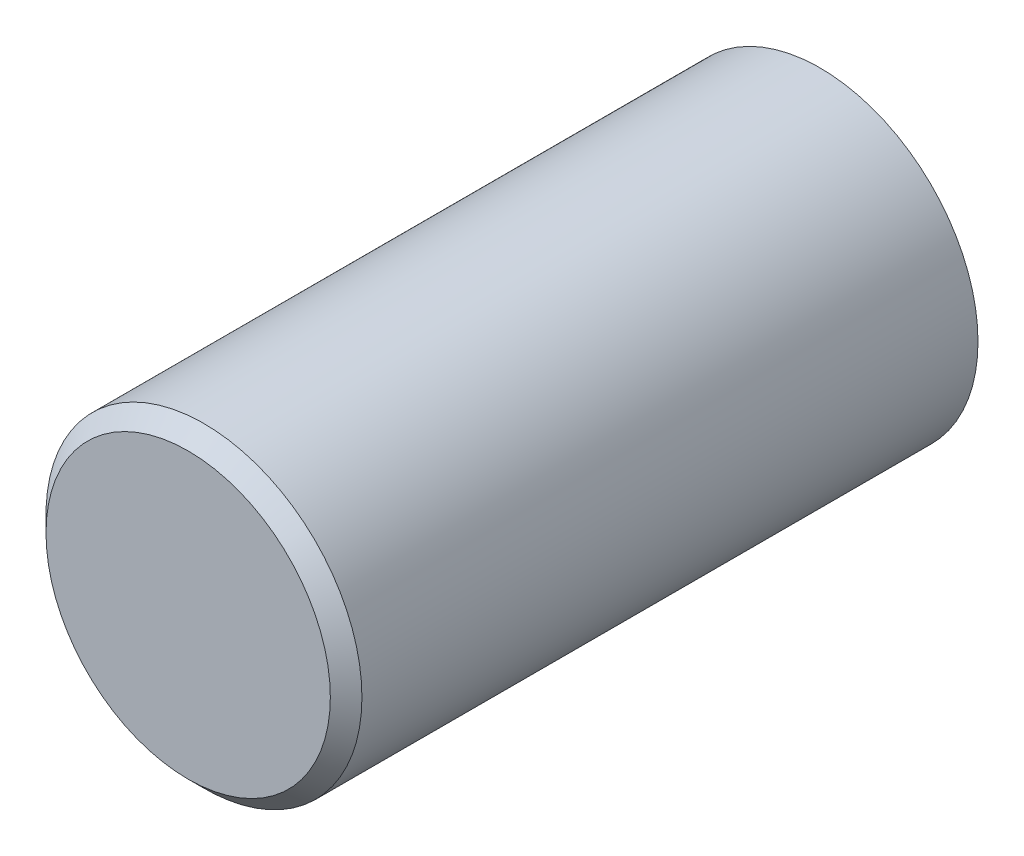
ISO-10303-21;
HEADER;
FILE_DESCRIPTION(('STEP AP214'),'2;1');
FILE_NAME('part.step','',(''),(''),'','','');
FILE_SCHEMA(('AUTOMOTIVE_DESIGN { 1 0 10303 214 1 1 1 1 }'));
ENDSEC;
DATA;
#1=APPLICATION_CONTEXT('core data for automotive mechanical design processes');
#2=APPLICATION_PROTOCOL_DEFINITION('international standard','automotive_design',2000,#1);
#3=PRODUCT_CONTEXT('',#1,'mechanical');
#4=PRODUCT('Part','Part','',(#3));
#5=PRODUCT_RELATED_PRODUCT_CATEGORY('part','',(#4));
#6=PRODUCT_DEFINITION_FORMATION('','',#4);
#7=PRODUCT_DEFINITION_CONTEXT('part definition',#1,'design');
#8=PRODUCT_DEFINITION('design','',#6,#7);
#9=PRODUCT_DEFINITION_SHAPE('','',#8);
#10=(LENGTH_UNIT() NAMED_UNIT(*) SI_UNIT(.MILLI.,.METRE.));
#11=(NAMED_UNIT(*) PLANE_ANGLE_UNIT() SI_UNIT($,.RADIAN.));
#12=(NAMED_UNIT(*) SI_UNIT($,.STERADIAN.) SOLID_ANGLE_UNIT());
#13=UNCERTAINTY_MEASURE_WITH_UNIT(LENGTH_MEASURE(1.E-05),#10,'distance_accuracy_value','');
#14=(GEOMETRIC_REPRESENTATION_CONTEXT(3) GLOBAL_UNCERTAINTY_ASSIGNED_CONTEXT((#13)) GLOBAL_UNIT_ASSIGNED_CONTEXT((#10,
#11,#12)) REPRESENTATION_CONTEXT('',''));
#15=CARTESIAN_POINT('',(0.,0.,0.));
#16=DIRECTION('',(0.,0.,1.));
#17=DIRECTION('',(1.,0.,0.));
#18=AXIS2_PLACEMENT_3D('',#15,#16,#17);
#19=CARTESIAN_POINT('',(0.,0.,40.));
#20=DIRECTION('',(0.,0.,-1.));
#21=DIRECTION('',(-1.,0.,0.));
#22=AXIS2_PLACEMENT_3D('',#19,#20,#21);
#23=CYLINDRICAL_SURFACE('',#22,10.);
#24=CARTESIAN_POINT('',(0.,0.,39.));
#25=DIRECTION('',(0.,0.,1.));
#26=DIRECTION('',(1.,0.,0.));
#27=AXIS2_PLACEMENT_3D('',#24,#25,#26);
#28=CIRCLE('',#27,10.);
#29=CARTESIAN_POINT('',(10.,0.,39.));
#30=VERTEX_POINT('',#29);
#31=EDGE_CURVE('E10',#30,#30,#28,.F.);
#32=ORIENTED_EDGE('',*,*,#31,.T.);
#33=EDGE_LOOP('',(#32));
#34=FACE_BOUND('',#33,.T.);
#35=CARTESIAN_POINT('',(0.,0.,0.));
#36=DIRECTION('',(0.,0.,1.));
#37=DIRECTION('',(1.,0.,0.));
#38=AXIS2_PLACEMENT_3D('',#35,#36,#37);
#39=CIRCLE('',#38,10.);
#40=CARTESIAN_POINT('',(10.,0.,0.));
#41=VERTEX_POINT('',#40);
#42=EDGE_CURVE('E35',#41,#41,#39,.T.);
#43=ORIENTED_EDGE('',*,*,#42,.T.);
#44=EDGE_LOOP('',(#43));
#45=FACE_BOUND('',#44,.T.);
#46=ADVANCED_FACE('F25',(#34,#45),#23,.T.);
#47=CARTESIAN_POINT('',(0.,0.,40.));
#48=DIRECTION('',(0.,0.,1.));
#49=DIRECTION('',(1.,0.,0.));
#50=AXIS2_PLACEMENT_3D('',#47,#48,#49);
#51=PLANE('',#50);
#52=CARTESIAN_POINT('',(0.,0.,40.));
#53=DIRECTION('',(0.,0.,1.));
#54=DIRECTION('',(1.,0.,0.));
#55=AXIS2_PLACEMENT_3D('',#52,#53,#54);
#56=CIRCLE('',#55,8.99999999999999);
#57=CARTESIAN_POINT('',(8.99999999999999,0.,40.));
#58=VERTEX_POINT('',#57);
#59=EDGE_CURVE('E31',#58,#58,#56,.T.);
#60=ORIENTED_EDGE('',*,*,#59,.T.);
#61=EDGE_LOOP('',(#60));
#62=FACE_BOUND('',#61,.T.);
#63=ADVANCED_FACE('F46',(#62),#51,.T.);
#64=CARTESIAN_POINT('',(0.,0.,0.));
#65=DIRECTION('',(0.,0.,1.));
#66=DIRECTION('',(1.,0.,0.));
#67=AXIS2_PLACEMENT_3D('',#64,#65,#66);
#68=PLANE('',#67);
#69=ORIENTED_EDGE('',*,*,#42,.F.);
#70=EDGE_LOOP('',(#69));
#71=FACE_BOUND('',#70,.T.);
#72=ADVANCED_FACE('F43',(#71),#68,.F.);
#73=CARTESIAN_POINT('',(0.,0.,40.));
#74=DIRECTION('',(0.,0.,-1.));
#75=DIRECTION('',(-1.,0.,0.));
#76=AXIS2_PLACEMENT_3D('',#73,#74,#75);
#77=CONICAL_SURFACE('',#76,8.99999999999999,0.785398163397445);
#78=ORIENTED_EDGE('',*,*,#31,.F.);
#79=EDGE_LOOP('',(#78));
#80=FACE_BOUND('',#79,.T.);
#81=ORIENTED_EDGE('',*,*,#59,.F.);
#82=EDGE_LOOP('',(#81));
#83=FACE_BOUND('',#82,.T.);
#84=ADVANCED_FACE('F45',(#80,#83),#77,.T.);
#85=CLOSED_SHELL('',(#46,#63,#72,#84));
#86=MANIFOLD_SOLID_BREP('B2',#85);
#87=ADVANCED_BREP_SHAPE_REPRESENTATION('',(#18,#86),#14);
#88=SHAPE_DEFINITION_REPRESENTATION(#9,#87);
ENDSEC;
END-ISO-10303-21;
